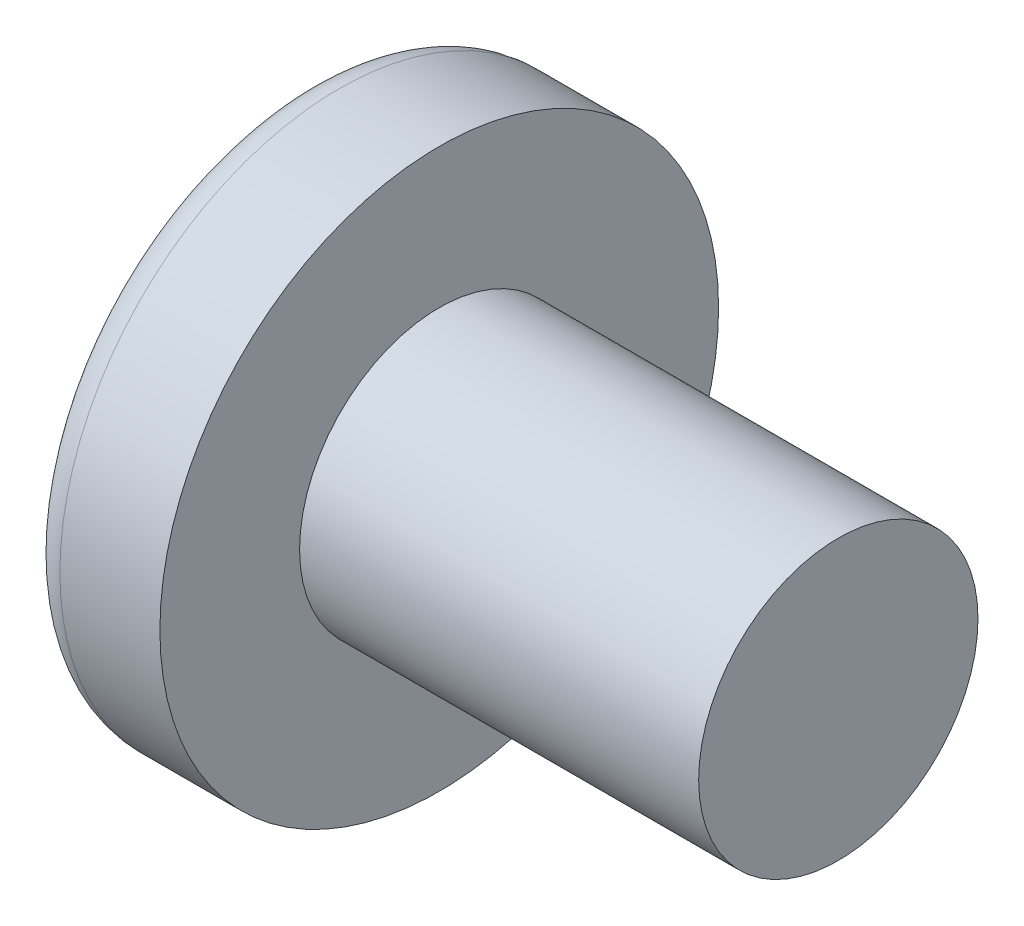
from build123d import *

# Parameters (mm, degrees)
CIRPATTERN1_COUNT = 2
CIRPATTERN1_ANGLE = 90


with BuildPart() as part:
    # BodySke → Base-Revolve (revolve)
    with BuildSketch(Plane.XY, mode=Mode.PRIVATE) as base_revolve_sk:
        with BuildLine():
            Line((2.6, 1.75), (2.6, 3.5))
            Line((2.6, 3.5), (1.34704395, 3.5))
            ThreePointArc((1.34704395, 3.5), (1.148257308, 3.449978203), (0.996821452, 3.311827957))
            ThreePointArc((0.996821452, 3.311827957), (0.254607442, 1.729295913), (0, 0))
            Line((0, 0), (7.6, 0))
            Line((7.6, 0), (7.6, 1.75))
            Line((7.6, 1.75), (2.6, 1.75))
        make_face()
    revolve(base_revolve_sk.sketch.rotate(Axis((-25.4, 0, 0), (1, 0, 0)), 90), axis=Axis((-25.4, 0, 0), (1, 0, 0)))

    # Sketch3 → Cut-Loft1 section 0
    with BuildSketch(Plane(origin=(0, 0, 0), x_dir=(0, 0, -1), z_dir=(1, 0, 0))):
        with BuildLine():
            Line((0.435, -1.96), (-0.435, -1.96))
            Line((-0.435, -1.96), (-0.435, 1.96))
            Line((-0.435, 1.96), (0.435, 1.96))
            Line((0.435, 1.96), (0.435, -1.96))
        make_face()
    # Sketch4 → Cut-Loft1 section 1
    with BuildSketch(Plane(origin=(1.95, 0, 0), x_dir=(0, 0, -1), z_dir=(1, 0, 0))):
        with BuildLine():
            Line((0.2175, -0.2175), (-0.2175, -0.2175))
            Line((-0.2175, -0.2175), (-0.2175, 0.2175))
            Line((-0.2175, 0.2175), (0.2175, 0.2175))
            Line((0.2175, 0.2175), (0.2175, -0.2175))
        make_face()
    cut_loft1 = loft(mode=Mode.SUBTRACT)

    # CirPattern1: Cut-Loft1 ×2 about axis
    cirpattern1_axis = Axis((0, 0, 0), (1, 0, 0))
    for i in range(1, CIRPATTERN1_COUNT):
        add(cut_loft1.rotate(cirpattern1_axis, i * CIRPATTERN1_ANGLE / (CIRPATTERN1_COUNT - 1)), mode=Mode.SUBTRACT)


solid = part.part
